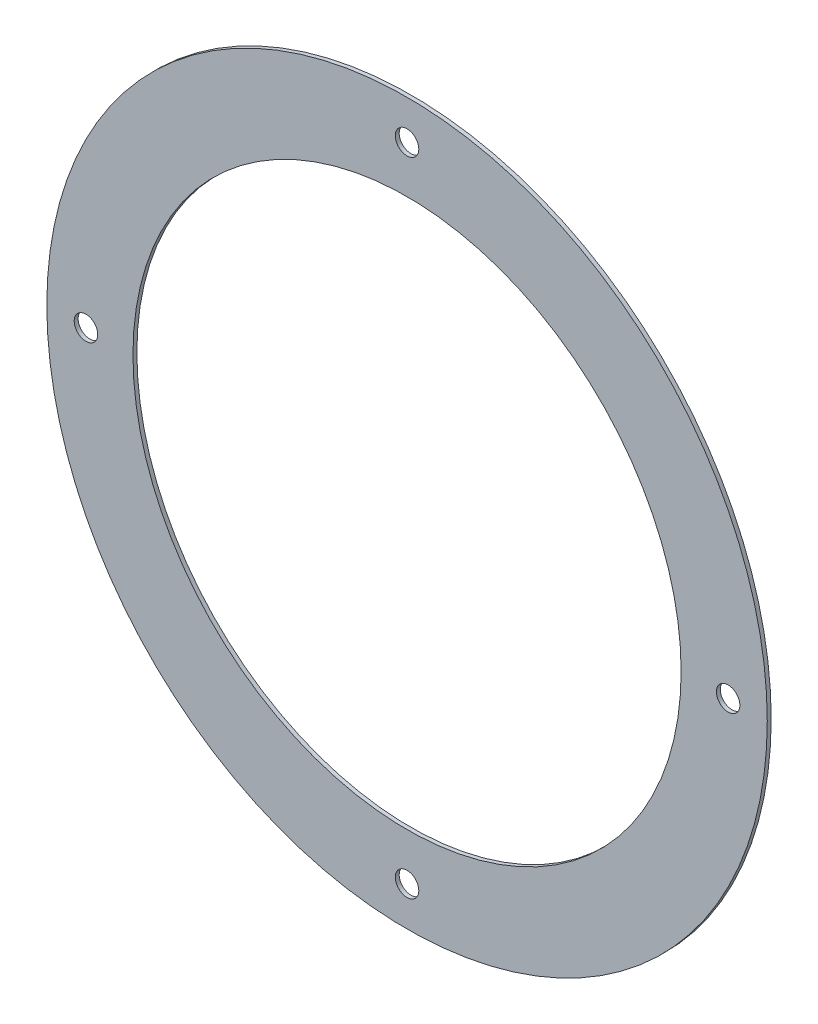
ISO-10303-21;
HEADER;
FILE_DESCRIPTION(('STEP AP214'),'2;1');
FILE_NAME('part.step','',(''),(''),'','','');
FILE_SCHEMA(('AUTOMOTIVE_DESIGN { 1 0 10303 214 1 1 1 1 }'));
ENDSEC;
DATA;
#1=APPLICATION_CONTEXT('core data for automotive mechanical design processes');
#2=APPLICATION_PROTOCOL_DEFINITION('international standard','automotive_design',2000,#1);
#3=PRODUCT_CONTEXT('',#1,'mechanical');
#4=PRODUCT('Part','Part','',(#3));
#5=PRODUCT_RELATED_PRODUCT_CATEGORY('part','',(#4));
#6=PRODUCT_DEFINITION_FORMATION('','',#4);
#7=PRODUCT_DEFINITION_CONTEXT('part definition',#1,'design');
#8=PRODUCT_DEFINITION('design','',#6,#7);
#9=PRODUCT_DEFINITION_SHAPE('','',#8);
#10=(LENGTH_UNIT() NAMED_UNIT(*) SI_UNIT(.MILLI.,.METRE.));
#11=(NAMED_UNIT(*) PLANE_ANGLE_UNIT() SI_UNIT($,.RADIAN.));
#12=(NAMED_UNIT(*) SI_UNIT($,.STERADIAN.) SOLID_ANGLE_UNIT());
#13=UNCERTAINTY_MEASURE_WITH_UNIT(LENGTH_MEASURE(1.E-05),#10,'distance_accuracy_value','');
#14=(GEOMETRIC_REPRESENTATION_CONTEXT(3) GLOBAL_UNCERTAINTY_ASSIGNED_CONTEXT((#13)) GLOBAL_UNIT_ASSIGNED_CONTEXT((#10,
#11,#12)) REPRESENTATION_CONTEXT('',''));
#15=CARTESIAN_POINT('',(0.,0.,0.));
#16=DIRECTION('',(0.,0.,1.));
#17=DIRECTION('',(1.,0.,0.));
#18=AXIS2_PLACEMENT_3D('',#15,#16,#17);
#19=CARTESIAN_POINT('',(0.,0.,1.));
#20=DIRECTION('',(0.,0.,1.));
#21=DIRECTION('',(1.,0.,0.));
#22=AXIS2_PLACEMENT_3D('',#19,#20,#21);
#23=PLANE('',#22);
#24=CARTESIAN_POINT('',(-5.57254828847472E-13,-82.,1.));
#25=DIRECTION('',(0.,0.,1.));
#26=DIRECTION('',(1.,0.,0.));
#27=AXIS2_PLACEMENT_3D('',#24,#25,#26);
#28=CIRCLE('',#27,3.);
#29=CARTESIAN_POINT('',(2.99999999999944,-82.,1.));
#30=VERTEX_POINT('',#29);
#31=EDGE_CURVE('E66',#30,#30,#28,.T.);
#32=ORIENTED_EDGE('',*,*,#31,.F.);
#33=EDGE_LOOP('',(#32));
#34=FACE_BOUND('',#33,.T.);
#35=CARTESIAN_POINT('',(82.,0.,1.));
#36=DIRECTION('',(0.,0.,1.));
#37=DIRECTION('',(1.,0.,0.));
#38=AXIS2_PLACEMENT_3D('',#35,#36,#37);
#39=CIRCLE('',#38,3.00000000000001);
#40=CARTESIAN_POINT('',(85.,0.,1.));
#41=VERTEX_POINT('',#40);
#42=EDGE_CURVE('E60',#41,#41,#39,.T.);
#43=ORIENTED_EDGE('',*,*,#42,.F.);
#44=EDGE_LOOP('',(#43));
#45=FACE_BOUND('',#44,.T.);
#46=CARTESIAN_POINT('',(-82.,0.,1.));
#47=DIRECTION('',(0.,0.,1.));
#48=DIRECTION('',(1.,0.,0.));
#49=AXIS2_PLACEMENT_3D('',#46,#47,#48);
#50=CIRCLE('',#49,3.00000000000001);
#51=CARTESIAN_POINT('',(-79.,0.,1.));
#52=VERTEX_POINT('',#51);
#53=EDGE_CURVE('E54',#52,#52,#50,.T.);
#54=ORIENTED_EDGE('',*,*,#53,.F.);
#55=EDGE_LOOP('',(#54));
#56=FACE_BOUND('',#55,.T.);
#57=CARTESIAN_POINT('',(-2.27126748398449E-13,82.,1.));
#58=DIRECTION('',(0.,0.,1.));
#59=DIRECTION('',(1.,0.,0.));
#60=AXIS2_PLACEMENT_3D('',#57,#58,#59);
#61=CIRCLE('',#60,3.);
#62=CARTESIAN_POINT('',(2.99999999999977,82.,1.));
#63=VERTEX_POINT('',#62);
#64=EDGE_CURVE('E48',#63,#63,#61,.T.);
#65=ORIENTED_EDGE('',*,*,#64,.F.);
#66=EDGE_LOOP('',(#65));
#67=FACE_BOUND('',#66,.T.);
#68=CARTESIAN_POINT('',(0.,0.,1.));
#69=DIRECTION('',(0.,0.,1.));
#70=DIRECTION('',(1.,0.,0.));
#71=AXIS2_PLACEMENT_3D('',#68,#69,#70);
#72=CIRCLE('',#71,92.);
#73=CARTESIAN_POINT('',(92.,0.,1.));
#74=VERTEX_POINT('',#73);
#75=EDGE_CURVE('E10',#74,#74,#72,.T.);
#76=ORIENTED_EDGE('',*,*,#75,.T.);
#77=EDGE_LOOP('',(#76));
#78=FACE_BOUND('',#77,.T.);
#79=CARTESIAN_POINT('',(0.,0.,1.));
#80=DIRECTION('',(0.,0.,1.));
#81=DIRECTION('',(1.,0.,0.));
#82=AXIS2_PLACEMENT_3D('',#79,#80,#81);
#83=CIRCLE('',#82,70.);
#84=CARTESIAN_POINT('',(70.,0.,1.));
#85=VERTEX_POINT('',#84);
#86=EDGE_CURVE('E36',#85,#85,#83,.T.);
#87=ORIENTED_EDGE('',*,*,#86,.F.);
#88=EDGE_LOOP('',(#87));
#89=FACE_BOUND('',#88,.T.);
#90=ADVANCED_FACE('F25',(#34,#45,#56,#67,#78,#89),#23,.T.);
#91=CARTESIAN_POINT('',(0.,0.,0.));
#92=DIRECTION('',(0.,0.,1.));
#93=DIRECTION('',(1.,0.,0.));
#94=AXIS2_PLACEMENT_3D('',#91,#92,#93);
#95=PLANE('',#94);
#96=CARTESIAN_POINT('',(-5.57254828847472E-13,-82.,0.));
#97=DIRECTION('',(0.,0.,1.));
#98=DIRECTION('',(1.,0.,0.));
#99=AXIS2_PLACEMENT_3D('',#96,#97,#98);
#100=CIRCLE('',#99,3.);
#101=CARTESIAN_POINT('',(2.99999999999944,-82.,0.));
#102=VERTEX_POINT('',#101);
#103=EDGE_CURVE('E63',#102,#102,#100,.T.);
#104=ORIENTED_EDGE('',*,*,#103,.T.);
#105=EDGE_LOOP('',(#104));
#106=FACE_BOUND('',#105,.T.);
#107=CARTESIAN_POINT('',(82.,0.,0.));
#108=DIRECTION('',(0.,0.,1.));
#109=DIRECTION('',(1.,0.,0.));
#110=AXIS2_PLACEMENT_3D('',#107,#108,#109);
#111=CIRCLE('',#110,3.00000000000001);
#112=CARTESIAN_POINT('',(85.,0.,0.));
#113=VERTEX_POINT('',#112);
#114=EDGE_CURVE('E57',#113,#113,#111,.T.);
#115=ORIENTED_EDGE('',*,*,#114,.T.);
#116=EDGE_LOOP('',(#115));
#117=FACE_BOUND('',#116,.T.);
#118=CARTESIAN_POINT('',(-82.,0.,0.));
#119=DIRECTION('',(0.,0.,1.));
#120=DIRECTION('',(1.,0.,0.));
#121=AXIS2_PLACEMENT_3D('',#118,#119,#120);
#122=CIRCLE('',#121,3.00000000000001);
#123=CARTESIAN_POINT('',(-79.,0.,0.));
#124=VERTEX_POINT('',#123);
#125=EDGE_CURVE('E51',#124,#124,#122,.T.);
#126=ORIENTED_EDGE('',*,*,#125,.T.);
#127=EDGE_LOOP('',(#126));
#128=FACE_BOUND('',#127,.T.);
#129=CARTESIAN_POINT('',(-2.27126748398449E-13,82.,0.));
#130=DIRECTION('',(0.,0.,1.));
#131=DIRECTION('',(1.,0.,0.));
#132=AXIS2_PLACEMENT_3D('',#129,#130,#131);
#133=CIRCLE('',#132,3.);
#134=CARTESIAN_POINT('',(2.99999999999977,82.,0.));
#135=VERTEX_POINT('',#134);
#136=EDGE_CURVE('E45',#135,#135,#133,.T.);
#137=ORIENTED_EDGE('',*,*,#136,.T.);
#138=EDGE_LOOP('',(#137));
#139=FACE_BOUND('',#138,.T.);
#140=CARTESIAN_POINT('',(0.,0.,0.));
#141=DIRECTION('',(0.,0.,1.));
#142=DIRECTION('',(1.,0.,0.));
#143=AXIS2_PLACEMENT_3D('',#140,#141,#142);
#144=CIRCLE('',#143,92.);
#145=CARTESIAN_POINT('',(92.,0.,0.));
#146=VERTEX_POINT('',#145);
#147=EDGE_CURVE('E32',#146,#146,#144,.T.);
#148=ORIENTED_EDGE('',*,*,#147,.F.);
#149=EDGE_LOOP('',(#148));
#150=FACE_BOUND('',#149,.T.);
#151=CARTESIAN_POINT('',(0.,0.,0.));
#152=DIRECTION('',(0.,0.,1.));
#153=DIRECTION('',(1.,0.,0.));
#154=AXIS2_PLACEMENT_3D('',#151,#152,#153);
#155=CIRCLE('',#154,70.);
#156=CARTESIAN_POINT('',(70.,0.,0.));
#157=VERTEX_POINT('',#156);
#158=EDGE_CURVE('E40',#157,#157,#155,.T.);
#159=ORIENTED_EDGE('',*,*,#158,.T.);
#160=EDGE_LOOP('',(#159));
#161=FACE_BOUND('',#160,.T.);
#162=ADVANCED_FACE('F74',(#106,#117,#128,#139,#150,#161),#95,.F.);
#163=CARTESIAN_POINT('',(0.,0.,1.));
#164=DIRECTION('',(0.,0.,-1.));
#165=DIRECTION('',(-1.,0.,0.));
#166=AXIS2_PLACEMENT_3D('',#163,#164,#165);
#167=CYLINDRICAL_SURFACE('',#166,92.);
#168=ORIENTED_EDGE('',*,*,#75,.F.);
#169=EDGE_LOOP('',(#168));
#170=FACE_BOUND('',#169,.T.);
#171=ORIENTED_EDGE('',*,*,#147,.T.);
#172=EDGE_LOOP('',(#171));
#173=FACE_BOUND('',#172,.T.);
#174=ADVANCED_FACE('F27',(#170,#173),#167,.T.);
#175=CARTESIAN_POINT('',(0.,0.,1.));
#176=DIRECTION('',(0.,0.,-1.));
#177=DIRECTION('',(-1.,0.,0.));
#178=AXIS2_PLACEMENT_3D('',#175,#176,#177);
#179=CYLINDRICAL_SURFACE('',#178,70.);
#180=ORIENTED_EDGE('',*,*,#86,.T.);
#181=EDGE_LOOP('',(#180));
#182=FACE_BOUND('',#181,.T.);
#183=ORIENTED_EDGE('',*,*,#158,.F.);
#184=EDGE_LOOP('',(#183));
#185=FACE_BOUND('',#184,.T.);
#186=ADVANCED_FACE('F83',(#182,#185),#179,.F.);
#187=CARTESIAN_POINT('',(-2.27126748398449E-13,82.,0.));
#188=DIRECTION('',(0.,0.,1.));
#189=DIRECTION('',(1.,0.,0.));
#190=AXIS2_PLACEMENT_3D('',#187,#188,#189);
#191=CYLINDRICAL_SURFACE('',#190,3.);
#192=ORIENTED_EDGE('',*,*,#136,.F.);
#193=EDGE_LOOP('',(#192));
#194=FACE_BOUND('',#193,.T.);
#195=ORIENTED_EDGE('',*,*,#64,.T.);
#196=EDGE_LOOP('',(#195));
#197=FACE_BOUND('',#196,.T.);
#198=ADVANCED_FACE('F86',(#194,#197),#191,.F.);
#199=CARTESIAN_POINT('',(-82.,0.,0.));
#200=DIRECTION('',(0.,0.,1.));
#201=DIRECTION('',(1.,0.,0.));
#202=AXIS2_PLACEMENT_3D('',#199,#200,#201);
#203=CYLINDRICAL_SURFACE('',#202,3.00000000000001);
#204=ORIENTED_EDGE('',*,*,#125,.F.);
#205=EDGE_LOOP('',(#204));
#206=FACE_BOUND('',#205,.T.);
#207=ORIENTED_EDGE('',*,*,#53,.T.);
#208=EDGE_LOOP('',(#207));
#209=FACE_BOUND('',#208,.T.);
#210=ADVANCED_FACE('F101',(#206,#209),#203,.F.);
#211=CARTESIAN_POINT('',(82.,0.,0.));
#212=DIRECTION('',(0.,0.,1.));
#213=DIRECTION('',(1.,0.,0.));
#214=AXIS2_PLACEMENT_3D('',#211,#212,#213);
#215=CYLINDRICAL_SURFACE('',#214,3.00000000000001);
#216=ORIENTED_EDGE('',*,*,#114,.F.);
#217=EDGE_LOOP('',(#216));
#218=FACE_BOUND('',#217,.T.);
#219=ORIENTED_EDGE('',*,*,#42,.T.);
#220=EDGE_LOOP('',(#219));
#221=FACE_BOUND('',#220,.T.);
#222=ADVANCED_FACE('F105',(#218,#221),#215,.F.);
#223=CARTESIAN_POINT('',(-5.57254828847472E-13,-82.,0.));
#224=DIRECTION('',(0.,0.,1.));
#225=DIRECTION('',(1.,0.,0.));
#226=AXIS2_PLACEMENT_3D('',#223,#224,#225);
#227=CYLINDRICAL_SURFACE('',#226,3.);
#228=ORIENTED_EDGE('',*,*,#103,.F.);
#229=EDGE_LOOP('',(#228));
#230=FACE_BOUND('',#229,.T.);
#231=ORIENTED_EDGE('',*,*,#31,.T.);
#232=EDGE_LOOP('',(#231));
#233=FACE_BOUND('',#232,.T.);
#234=ADVANCED_FACE('F70',(#230,#233),#227,.F.);
#235=CLOSED_SHELL('',(#90,#162,#174,#186,#198,#210,#222,#234));
#236=MANIFOLD_SOLID_BREP('B2',#235);
#237=ADVANCED_BREP_SHAPE_REPRESENTATION('',(#18,#236),#14);
#238=SHAPE_DEFINITION_REPRESENTATION(#9,#237);
ENDSEC;
END-ISO-10303-21;
